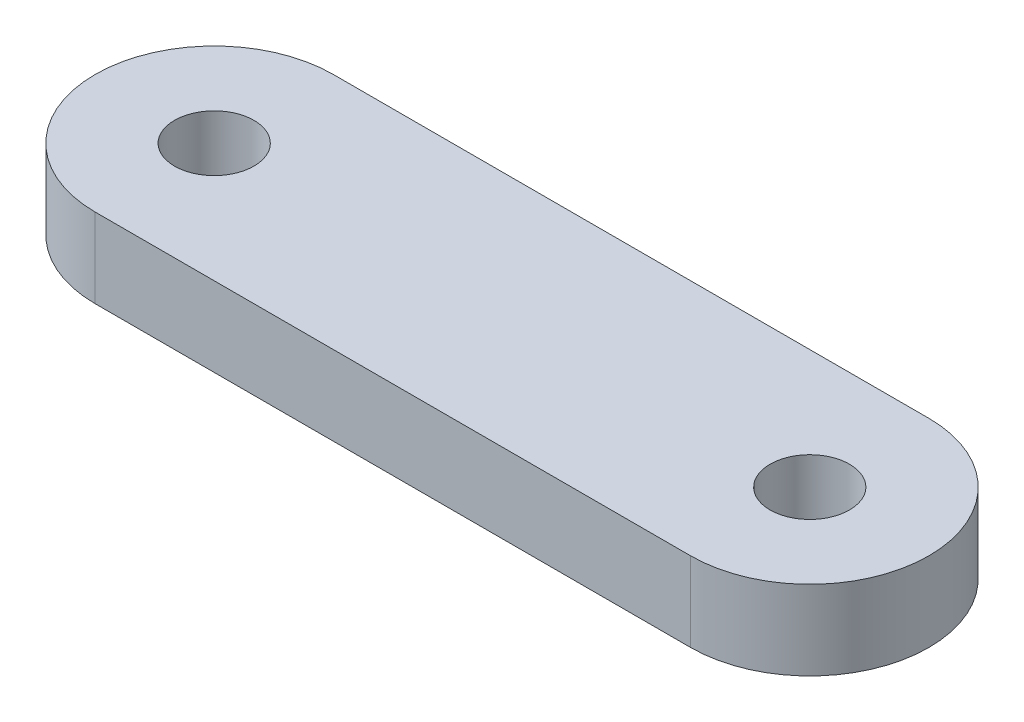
from build123d import *

# Parameters (mm, degrees)
SKETCH1_R      = 1
EXTRUDE1_DEPTH = 2


with BuildPart() as part:
    # Sketch1 → Extrude1 (new body)
    with BuildSketch(Plane(origin=(0, 0, 0), x_dir=(1, 0, 0), z_dir=(0, 1, 0))):
        with BuildLine():
            Line((-7.5, -3), (7.5, -3))
            ThreePointArc((7.5, -3), (10.5, 0), (7.5, 3))
            Line((7.5, 3), (-7.5, 3))
            ThreePointArc((-7.5, 3), (-10.5, 0), (-7.5, -3))
        make_face()
        with Locations(Location((-7.5, 0, 0), (0, 0, 270))):
            Circle(SKETCH1_R, mode=Mode.SUBTRACT)
        with Locations(Location((7.5, 0, 0), (0, 0, 270))):
            Circle(SKETCH1_R, mode=Mode.SUBTRACT)
    extrude(amount=EXTRUDE1_DEPTH)


solid = part.part
